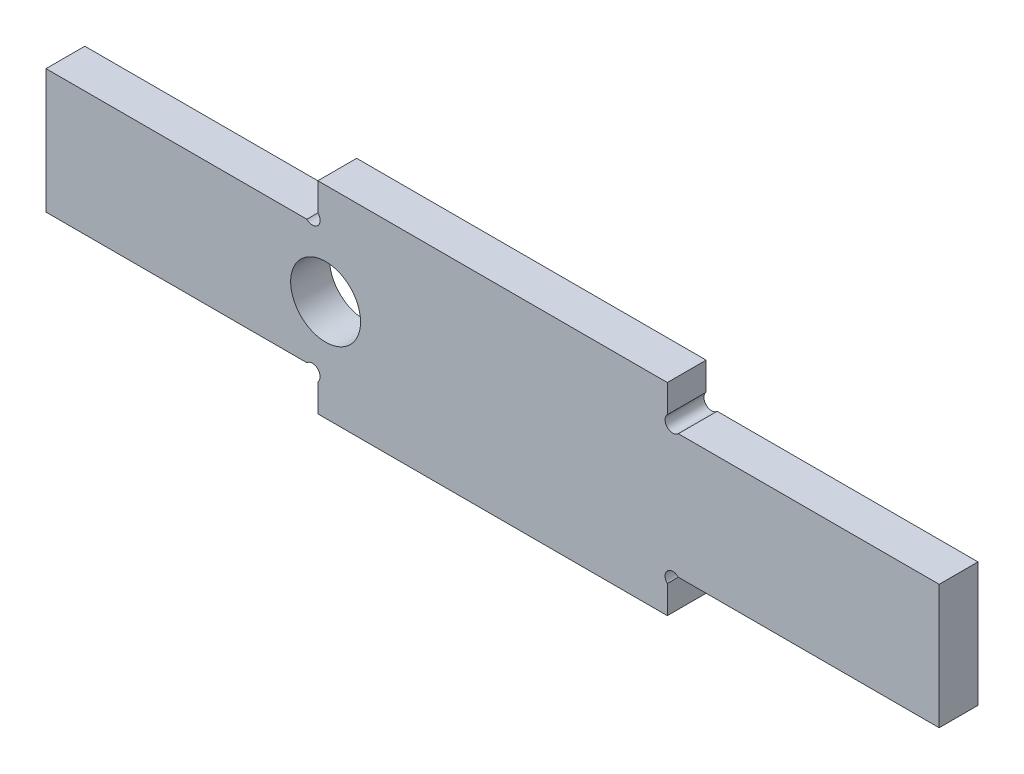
ISO-10303-21;
HEADER;
FILE_DESCRIPTION(('STEP AP214'),'2;1');
FILE_NAME('part.step','',(''),(''),'','','');
FILE_SCHEMA(('AUTOMOTIVE_DESIGN { 1 0 10303 214 1 1 1 1 }'));
ENDSEC;
DATA;
#1=APPLICATION_CONTEXT('core data for automotive mechanical design processes');
#2=APPLICATION_PROTOCOL_DEFINITION('international standard','automotive_design',2000,#1);
#3=PRODUCT_CONTEXT('',#1,'mechanical');
#4=PRODUCT('Part','Part','',(#3));
#5=PRODUCT_RELATED_PRODUCT_CATEGORY('part','',(#4));
#6=PRODUCT_DEFINITION_FORMATION('','',#4);
#7=PRODUCT_DEFINITION_CONTEXT('part definition',#1,'design');
#8=PRODUCT_DEFINITION('design','',#6,#7);
#9=PRODUCT_DEFINITION_SHAPE('','',#8);
#10=(LENGTH_UNIT() NAMED_UNIT(*) SI_UNIT(.MILLI.,.METRE.));
#11=(NAMED_UNIT(*) PLANE_ANGLE_UNIT() SI_UNIT($,.RADIAN.));
#12=(NAMED_UNIT(*) SI_UNIT($,.STERADIAN.) SOLID_ANGLE_UNIT());
#13=UNCERTAINTY_MEASURE_WITH_UNIT(LENGTH_MEASURE(1.E-05),#10,'distance_accuracy_value','');
#14=(GEOMETRIC_REPRESENTATION_CONTEXT(3) GLOBAL_UNCERTAINTY_ASSIGNED_CONTEXT((#13)) GLOBAL_UNIT_ASSIGNED_CONTEXT((#10,
#11,#12)) REPRESENTATION_CONTEXT('',''));
#15=CARTESIAN_POINT('',(0.,0.,0.));
#16=DIRECTION('',(0.,0.,1.));
#17=DIRECTION('',(1.,0.,0.));
#18=AXIS2_PLACEMENT_3D('',#15,#16,#17);
#19=CARTESIAN_POINT('',(0.,26.,5.));
#20=DIRECTION('',(0.,0.,-1.));
#21=DIRECTION('',(-1.,0.,0.));
#22=AXIS2_PLACEMENT_3D('',#19,#20,#21);
#23=PLANE('',#22);
#24=CARTESIAN_POINT('',(36.,13.,5.));
#25=DIRECTION('',(0.,0.,1.));
#26=DIRECTION('',(1.,0.,0.));
#27=AXIS2_PLACEMENT_3D('',#24,#25,#26);
#28=CIRCLE('',#27,4.5);
#29=CARTESIAN_POINT('',(40.5,13.,5.));
#30=VERTEX_POINT('',#29);
#31=EDGE_CURVE('E166',#30,#30,#28,.T.);
#32=ORIENTED_EDGE('',*,*,#31,.F.);
#33=EDGE_LOOP('',(#32));
#34=FACE_BOUND('',#33,.T.);
#35=DIRECTION('',(0.,1.,0.));
#36=VECTOR('',#35,1.);
#37=CARTESIAN_POINT('',(80.,0.,5.));
#38=LINE('',#37,#36);
#39=CARTESIAN_POINT('',(80.,0.,5.));
#40=VERTEX_POINT('',#39);
#41=CARTESIAN_POINT('',(80.,3.5857864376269,5.));
#42=VERTEX_POINT('',#41);
#43=EDGE_CURVE('E49',#40,#42,#38,.T.);
#44=ORIENTED_EDGE('',*,*,#43,.T.);
#45=CARTESIAN_POINT('',(80.7071067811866,4.29289321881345,5.));
#46=DIRECTION('',(0.,0.,-1.));
#47=DIRECTION('',(-1.,0.,0.));
#48=AXIS2_PLACEMENT_3D('',#45,#46,#47);
#49=CIRCLE('',#48,0.999999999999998);
#50=CARTESIAN_POINT('',(81.4142135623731,5.,5.));
#51=VERTEX_POINT('',#50);
#52=EDGE_CURVE('E160',#42,#51,#49,.T.);
#53=ORIENTED_EDGE('',*,*,#52,.T.);
#54=DIRECTION('',(1.,0.,0.));
#55=VECTOR('',#54,1.);
#56=CARTESIAN_POINT('',(115.,5.,5.));
#57=LINE('',#56,#55);
#58=CARTESIAN_POINT('',(115.,5.,5.));
#59=VERTEX_POINT('',#58);
#60=EDGE_CURVE('E170',#51,#59,#57,.T.);
#61=ORIENTED_EDGE('',*,*,#60,.T.);
#62=DIRECTION('',(0.,-1.,0.));
#63=VECTOR('',#62,1.);
#64=CARTESIAN_POINT('',(115.,0.,5.));
#65=LINE('',#64,#63);
#66=CARTESIAN_POINT('',(115.,21.,5.));
#67=VERTEX_POINT('',#66);
#68=EDGE_CURVE('E198',#67,#59,#65,.T.);
#69=ORIENTED_EDGE('',*,*,#68,.F.);
#70=DIRECTION('',(-1.,0.,0.));
#71=VECTOR('',#70,1.);
#72=CARTESIAN_POINT('',(115.,21.,5.));
#73=LINE('',#72,#71);
#74=CARTESIAN_POINT('',(81.4142135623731,21.,5.));
#75=VERTEX_POINT('',#74);
#76=EDGE_CURVE('E57',#67,#75,#73,.T.);
#77=ORIENTED_EDGE('',*,*,#76,.T.);
#78=CARTESIAN_POINT('',(80.7071067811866,21.7071067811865,5.));
#79=DIRECTION('',(0.,0.,-1.));
#80=DIRECTION('',(-1.,0.,0.));
#81=AXIS2_PLACEMENT_3D('',#78,#79,#80);
#82=CIRCLE('',#81,0.999999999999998);
#83=CARTESIAN_POINT('',(80.,22.4142135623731,5.));
#84=VERTEX_POINT('',#83);
#85=EDGE_CURVE('E174',#75,#84,#82,.T.);
#86=ORIENTED_EDGE('',*,*,#85,.T.);
#87=DIRECTION('',(0.,1.,0.));
#88=VECTOR('',#87,1.);
#89=CARTESIAN_POINT('',(80.,26.,5.));
#90=LINE('',#89,#88);
#91=CARTESIAN_POINT('',(80.,26.,5.));
#92=VERTEX_POINT('',#91);
#93=EDGE_CURVE('E189',#84,#92,#90,.T.);
#94=ORIENTED_EDGE('',*,*,#93,.T.);
#95=DIRECTION('',(-1.,0.,0.));
#96=VECTOR('',#95,1.);
#97=CARTESIAN_POINT('',(0.,26.,5.));
#98=LINE('',#97,#96);
#99=CARTESIAN_POINT('',(35.,26.,5.));
#100=VERTEX_POINT('',#99);
#101=EDGE_CURVE('E11',#92,#100,#98,.T.);
#102=ORIENTED_EDGE('',*,*,#101,.T.);
#103=DIRECTION('',(0.,1.,0.));
#104=VECTOR('',#103,1.);
#105=CARTESIAN_POINT('',(35.,26.,5.));
#106=LINE('',#105,#104);
#107=CARTESIAN_POINT('',(35.,22.4142135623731,5.));
#108=VERTEX_POINT('',#107);
#109=EDGE_CURVE('E241',#108,#100,#106,.T.);
#110=ORIENTED_EDGE('',*,*,#109,.F.);
#111=CARTESIAN_POINT('',(34.2928932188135,21.7071067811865,5.));
#112=DIRECTION('',(0.,0.,1.));
#113=DIRECTION('',(1.,0.,0.));
#114=AXIS2_PLACEMENT_3D('',#111,#112,#113);
#115=CIRCLE('',#114,0.999999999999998);
#116=CARTESIAN_POINT('',(33.5857864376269,21.,5.));
#117=VERTEX_POINT('',#116);
#118=EDGE_CURVE('E216',#117,#108,#115,.T.);
#119=ORIENTED_EDGE('',*,*,#118,.F.);
#120=DIRECTION('',(1.,0.,0.));
#121=VECTOR('',#120,1.);
#122=CARTESIAN_POINT('',(0.,21.,5.));
#123=LINE('',#122,#121);
#124=CARTESIAN_POINT('',(0.,21.,5.));
#125=VERTEX_POINT('',#124);
#126=EDGE_CURVE('E238',#125,#117,#123,.T.);
#127=ORIENTED_EDGE('',*,*,#126,.F.);
#128=DIRECTION('',(0.,-1.,0.));
#129=VECTOR('',#128,1.);
#130=CARTESIAN_POINT('',(0.,0.,5.));
#131=LINE('',#130,#129);
#132=CARTESIAN_POINT('',(0.,5.,5.));
#133=VERTEX_POINT('',#132);
#134=EDGE_CURVE('E253',#125,#133,#131,.T.);
#135=ORIENTED_EDGE('',*,*,#134,.T.);
#136=DIRECTION('',(-1.,0.,0.));
#137=VECTOR('',#136,1.);
#138=CARTESIAN_POINT('',(0.,5.,5.));
#139=LINE('',#138,#137);
#140=CARTESIAN_POINT('',(33.5857864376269,5.,5.));
#141=VERTEX_POINT('',#140);
#142=EDGE_CURVE('E228',#141,#133,#139,.T.);
#143=ORIENTED_EDGE('',*,*,#142,.F.);
#144=CARTESIAN_POINT('',(34.2928932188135,4.29289321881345,5.));
#145=DIRECTION('',(0.,0.,1.));
#146=DIRECTION('',(1.,0.,0.));
#147=AXIS2_PLACEMENT_3D('',#144,#145,#146);
#148=CIRCLE('',#147,0.999999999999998);
#149=CARTESIAN_POINT('',(35.,3.5857864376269,5.));
#150=VERTEX_POINT('',#149);
#151=EDGE_CURVE('E210',#150,#141,#148,.T.);
#152=ORIENTED_EDGE('',*,*,#151,.F.);
#153=DIRECTION('',(0.,1.,0.));
#154=VECTOR('',#153,1.);
#155=CARTESIAN_POINT('',(35.,0.,5.));
#156=LINE('',#155,#154);
#157=CARTESIAN_POINT('',(35.,0.,5.));
#158=VERTEX_POINT('',#157);
#159=EDGE_CURVE('E225',#158,#150,#156,.T.);
#160=ORIENTED_EDGE('',*,*,#159,.F.);
#161=DIRECTION('',(1.,0.,0.));
#162=VECTOR('',#161,1.);
#163=CARTESIAN_POINT('',(0.,0.,5.));
#164=LINE('',#163,#162);
#165=EDGE_CURVE('E41',#158,#40,#164,.T.);
#166=ORIENTED_EDGE('',*,*,#165,.T.);
#167=EDGE_LOOP('',(#44,#53,#61,#69,#77,#86,#94,#102,#110,#119,#127,#135,#143,#152,#160,#166));
#168=FACE_BOUND('',#167,.T.);
#169=ADVANCED_FACE('F32',(#34,#168),#23,.F.);
#170=CARTESIAN_POINT('',(0.,26.,0.));
#171=DIRECTION('',(0.,0.,-1.));
#172=DIRECTION('',(-1.,0.,0.));
#173=AXIS2_PLACEMENT_3D('',#170,#171,#172);
#174=PLANE('',#173);
#175=CARTESIAN_POINT('',(36.,13.,0.));
#176=DIRECTION('',(0.,0.,-1.));
#177=DIRECTION('',(-1.,0.,0.));
#178=AXIS2_PLACEMENT_3D('',#175,#176,#177);
#179=CIRCLE('',#178,4.5);
#180=CARTESIAN_POINT('',(31.5,13.,0.));
#181=VERTEX_POINT('',#180);
#182=EDGE_CURVE('E301',#181,#181,#179,.F.);
#183=ORIENTED_EDGE('',*,*,#182,.T.);
#184=EDGE_LOOP('',(#183));
#185=FACE_BOUND('',#184,.T.);
#186=CARTESIAN_POINT('',(80.7071067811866,4.29289321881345,0.));
#187=DIRECTION('',(0.,0.,-1.));
#188=DIRECTION('',(-1.,0.,0.));
#189=AXIS2_PLACEMENT_3D('',#186,#187,#188);
#190=CIRCLE('',#189,0.999999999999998);
#191=CARTESIAN_POINT('',(80.,3.5857864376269,0.));
#192=VERTEX_POINT('',#191);
#193=CARTESIAN_POINT('',(81.4142135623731,5.,0.));
#194=VERTEX_POINT('',#193);
#195=EDGE_CURVE('E148',#192,#194,#190,.T.);
#196=ORIENTED_EDGE('',*,*,#195,.F.);
#197=DIRECTION('',(0.,1.,0.));
#198=VECTOR('',#197,1.);
#199=CARTESIAN_POINT('',(80.,0.,0.));
#200=LINE('',#199,#198);
#201=CARTESIAN_POINT('',(80.,0.,0.));
#202=VERTEX_POINT('',#201);
#203=EDGE_CURVE('E153',#202,#192,#200,.T.);
#204=ORIENTED_EDGE('',*,*,#203,.F.);
#205=DIRECTION('',(1.,0.,0.));
#206=VECTOR('',#205,1.);
#207=CARTESIAN_POINT('',(0.,0.,0.));
#208=LINE('',#207,#206);
#209=CARTESIAN_POINT('',(35.,0.,0.));
#210=VERTEX_POINT('',#209);
#211=EDGE_CURVE('E259',#210,#202,#208,.T.);
#212=ORIENTED_EDGE('',*,*,#211,.F.);
#213=DIRECTION('',(0.,1.,0.));
#214=VECTOR('',#213,1.);
#215=CARTESIAN_POINT('',(35.,0.,0.));
#216=LINE('',#215,#214);
#217=CARTESIAN_POINT('',(35.,3.5857864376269,0.));
#218=VERTEX_POINT('',#217);
#219=EDGE_CURVE('E220',#210,#218,#216,.T.);
#220=ORIENTED_EDGE('',*,*,#219,.T.);
#221=CARTESIAN_POINT('',(34.2928932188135,4.29289321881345,0.));
#222=DIRECTION('',(0.,0.,-1.));
#223=DIRECTION('',(-1.,0.,0.));
#224=AXIS2_PLACEMENT_3D('',#221,#222,#223);
#225=CIRCLE('',#224,0.999999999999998);
#226=CARTESIAN_POINT('',(33.5857864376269,5.,0.));
#227=VERTEX_POINT('',#226);
#228=EDGE_CURVE('E212',#218,#227,#225,.F.);
#229=ORIENTED_EDGE('',*,*,#228,.T.);
#230=DIRECTION('',(-1.,0.,0.));
#231=VECTOR('',#230,1.);
#232=CARTESIAN_POINT('',(0.,5.,0.));
#233=LINE('',#232,#231);
#234=CARTESIAN_POINT('',(0.,5.,0.));
#235=VERTEX_POINT('',#234);
#236=EDGE_CURVE('E223',#227,#235,#233,.T.);
#237=ORIENTED_EDGE('',*,*,#236,.T.);
#238=DIRECTION('',(0.,-1.,0.));
#239=VECTOR('',#238,1.);
#240=CARTESIAN_POINT('',(0.,0.,0.));
#241=LINE('',#240,#239);
#242=CARTESIAN_POINT('',(0.,21.,0.));
#243=VERTEX_POINT('',#242);
#244=EDGE_CURVE('E252',#243,#235,#241,.T.);
#245=ORIENTED_EDGE('',*,*,#244,.F.);
#246=DIRECTION('',(1.,0.,0.));
#247=VECTOR('',#246,1.);
#248=CARTESIAN_POINT('',(0.,21.,0.));
#249=LINE('',#248,#247);
#250=CARTESIAN_POINT('',(33.5857864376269,21.,0.));
#251=VERTEX_POINT('',#250);
#252=EDGE_CURVE('E248',#243,#251,#249,.T.);
#253=ORIENTED_EDGE('',*,*,#252,.T.);
#254=CARTESIAN_POINT('',(34.2928932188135,21.7071067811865,0.));
#255=DIRECTION('',(0.,0.,-1.));
#256=DIRECTION('',(-1.,0.,0.));
#257=AXIS2_PLACEMENT_3D('',#254,#255,#256);
#258=CIRCLE('',#257,0.999999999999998);
#259=CARTESIAN_POINT('',(35.,22.4142135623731,0.));
#260=VERTEX_POINT('',#259);
#261=EDGE_CURVE('E218',#251,#260,#258,.F.);
#262=ORIENTED_EDGE('',*,*,#261,.T.);
#263=DIRECTION('',(0.,1.,0.));
#264=VECTOR('',#263,1.);
#265=CARTESIAN_POINT('',(35.,26.,0.));
#266=LINE('',#265,#264);
#267=CARTESIAN_POINT('',(35.,26.,0.));
#268=VERTEX_POINT('',#267);
#269=EDGE_CURVE('E234',#260,#268,#266,.T.);
#270=ORIENTED_EDGE('',*,*,#269,.T.);
#271=DIRECTION('',(-1.,0.,0.));
#272=VECTOR('',#271,1.);
#273=CARTESIAN_POINT('',(0.,26.,0.));
#274=LINE('',#273,#272);
#275=CARTESIAN_POINT('',(80.,26.,0.));
#276=VERTEX_POINT('',#275);
#277=EDGE_CURVE('E36',#276,#268,#274,.T.);
#278=ORIENTED_EDGE('',*,*,#277,.F.);
#279=DIRECTION('',(0.,1.,0.));
#280=VECTOR('',#279,1.);
#281=CARTESIAN_POINT('',(80.,26.,0.));
#282=LINE('',#281,#280);
#283=CARTESIAN_POINT('',(80.,22.4142135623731,0.));
#284=VERTEX_POINT('',#283);
#285=EDGE_CURVE('E184',#284,#276,#282,.T.);
#286=ORIENTED_EDGE('',*,*,#285,.F.);
#287=CARTESIAN_POINT('',(80.7071067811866,21.7071067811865,0.));
#288=DIRECTION('',(0.,0.,-1.));
#289=DIRECTION('',(-1.,0.,0.));
#290=AXIS2_PLACEMENT_3D('',#287,#288,#289);
#291=CIRCLE('',#290,0.999999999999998);
#292=CARTESIAN_POINT('',(81.4142135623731,21.,0.));
#293=VERTEX_POINT('',#292);
#294=EDGE_CURVE('E171',#293,#284,#291,.T.);
#295=ORIENTED_EDGE('',*,*,#294,.F.);
#296=DIRECTION('',(-1.,0.,0.));
#297=VECTOR('',#296,1.);
#298=CARTESIAN_POINT('',(115.,21.,0.));
#299=LINE('',#298,#297);
#300=CARTESIAN_POINT('',(115.,21.,0.));
#301=VERTEX_POINT('',#300);
#302=EDGE_CURVE('E186',#301,#293,#299,.T.);
#303=ORIENTED_EDGE('',*,*,#302,.F.);
#304=DIRECTION('',(0.,-1.,0.));
#305=VECTOR('',#304,1.);
#306=CARTESIAN_POINT('',(115.,0.,0.));
#307=LINE('',#306,#305);
#308=CARTESIAN_POINT('',(115.,5.,0.));
#309=VERTEX_POINT('',#308);
#310=EDGE_CURVE('E195',#301,#309,#307,.T.);
#311=ORIENTED_EDGE('',*,*,#310,.T.);
#312=DIRECTION('',(1.,0.,0.));
#313=VECTOR('',#312,1.);
#314=CARTESIAN_POINT('',(115.,5.,0.));
#315=LINE('',#314,#313);
#316=EDGE_CURVE('E156',#194,#309,#315,.T.);
#317=ORIENTED_EDGE('',*,*,#316,.F.);
#318=EDGE_LOOP('',(#196,#204,#212,#220,#229,#237,#245,#253,#262,#270,#278,#286,#295,#303,#311,#317));
#319=FACE_BOUND('',#318,.T.);
#320=ADVANCED_FACE('F150',(#185,#319),#174,.T.);
#321=CARTESIAN_POINT('',(80.,0.,-0.00100000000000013));
#322=DIRECTION('',(1.,0.,0.));
#323=DIRECTION('',(0.,0.,-1.));
#324=AXIS2_PLACEMENT_3D('',#321,#322,#323);
#325=PLANE('',#324);
#326=ORIENTED_EDGE('',*,*,#203,.T.);
#327=DIRECTION('',(0.,0.,1.));
#328=VECTOR('',#327,1.);
#329=CARTESIAN_POINT('',(80.,3.5857864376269,-0.00100000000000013));
#330=LINE('',#329,#328);
#331=EDGE_CURVE('E162',#42,#192,#330,.F.);
#332=ORIENTED_EDGE('',*,*,#331,.F.);
#333=ORIENTED_EDGE('',*,*,#43,.F.);
#334=DIRECTION('',(0.,0.,1.));
#335=VECTOR('',#334,1.);
#336=CARTESIAN_POINT('',(80.,0.,-0.00100000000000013));
#337=LINE('',#336,#335);
#338=EDGE_CURVE('E169',#202,#40,#337,.T.);
#339=ORIENTED_EDGE('',*,*,#338,.F.);
#340=EDGE_LOOP('',(#326,#332,#333,#339));
#341=FACE_BOUND('',#340,.T.);
#342=ADVANCED_FACE('F168',(#341),#325,.T.);
#343=CARTESIAN_POINT('',(115.,21.,-0.00100000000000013));
#344=DIRECTION('',(0.,1.,0.));
#345=DIRECTION('',(0.,0.,1.));
#346=AXIS2_PLACEMENT_3D('',#343,#344,#345);
#347=PLANE('',#346);
#348=ORIENTED_EDGE('',*,*,#302,.T.);
#349=DIRECTION('',(0.,0.,1.));
#350=VECTOR('',#349,1.);
#351=CARTESIAN_POINT('',(81.4142135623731,21.,-0.00100000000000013));
#352=LINE('',#351,#350);
#353=EDGE_CURVE('E165',#75,#293,#352,.F.);
#354=ORIENTED_EDGE('',*,*,#353,.F.);
#355=ORIENTED_EDGE('',*,*,#76,.F.);
#356=DIRECTION('',(0.,0.,1.));
#357=VECTOR('',#356,1.);
#358=CARTESIAN_POINT('',(115.,21.,-0.00100000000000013));
#359=LINE('',#358,#357);
#360=EDGE_CURVE('E193',#301,#67,#359,.T.);
#361=ORIENTED_EDGE('',*,*,#360,.F.);
#362=EDGE_LOOP('',(#348,#354,#355,#361));
#363=FACE_BOUND('',#362,.T.);
#364=ADVANCED_FACE('F289',(#363),#347,.T.);
#365=CARTESIAN_POINT('',(115.,5.,-0.00100000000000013));
#366=DIRECTION('',(0.,-1.,0.));
#367=DIRECTION('',(0.,0.,-1.));
#368=AXIS2_PLACEMENT_3D('',#365,#366,#367);
#369=PLANE('',#368);
#370=ORIENTED_EDGE('',*,*,#60,.F.);
#371=DIRECTION('',(0.,0.,1.));
#372=VECTOR('',#371,1.);
#373=CARTESIAN_POINT('',(81.4142135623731,5.,-0.00100000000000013));
#374=LINE('',#373,#372);
#375=EDGE_CURVE('E287',#194,#51,#374,.T.);
#376=ORIENTED_EDGE('',*,*,#375,.F.);
#377=ORIENTED_EDGE('',*,*,#316,.T.);
#378=DIRECTION('',(0.,0.,1.));
#379=VECTOR('',#378,1.);
#380=CARTESIAN_POINT('',(115.,5.,-0.00100000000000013));
#381=LINE('',#380,#379);
#382=EDGE_CURVE('E179',#309,#59,#381,.T.);
#383=ORIENTED_EDGE('',*,*,#382,.T.);
#384=EDGE_LOOP('',(#370,#376,#377,#383));
#385=FACE_BOUND('',#384,.T.);
#386=ADVANCED_FACE('F296',(#385),#369,.T.);
#387=CARTESIAN_POINT('',(80.,26.,-0.00100000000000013));
#388=DIRECTION('',(1.,0.,0.));
#389=DIRECTION('',(0.,0.,-1.));
#390=AXIS2_PLACEMENT_3D('',#387,#388,#389);
#391=PLANE('',#390);
#392=ORIENTED_EDGE('',*,*,#93,.F.);
#393=DIRECTION('',(0.,0.,1.));
#394=VECTOR('',#393,1.);
#395=CARTESIAN_POINT('',(80.,22.4142135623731,-0.00100000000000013));
#396=LINE('',#395,#394);
#397=EDGE_CURVE('E159',#284,#84,#396,.T.);
#398=ORIENTED_EDGE('',*,*,#397,.F.);
#399=ORIENTED_EDGE('',*,*,#285,.T.);
#400=DIRECTION('',(0.,0.,1.));
#401=VECTOR('',#400,1.);
#402=CARTESIAN_POINT('',(80.,26.,-0.00100000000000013));
#403=LINE('',#402,#401);
#404=EDGE_CURVE('E192',#276,#92,#403,.T.);
#405=ORIENTED_EDGE('',*,*,#404,.T.);
#406=EDGE_LOOP('',(#392,#398,#399,#405));
#407=FACE_BOUND('',#406,.T.);
#408=ADVANCED_FACE('F281',(#407),#391,.T.);
#409=CARTESIAN_POINT('',(115.,0.,5.));
#410=DIRECTION('',(1.,0.,0.));
#411=DIRECTION('',(0.,0.,-1.));
#412=AXIS2_PLACEMENT_3D('',#409,#410,#411);
#413=PLANE('',#412);
#414=ORIENTED_EDGE('',*,*,#68,.T.);
#415=ORIENTED_EDGE('',*,*,#382,.F.);
#416=ORIENTED_EDGE('',*,*,#310,.F.);
#417=ORIENTED_EDGE('',*,*,#360,.T.);
#418=EDGE_LOOP('',(#414,#415,#416,#417));
#419=FACE_BOUND('',#418,.T.);
#420=ADVANCED_FACE('F292',(#419),#413,.T.);
#421=CARTESIAN_POINT('',(0.,0.,5.));
#422=DIRECTION('',(0.,1.,0.));
#423=DIRECTION('',(0.,0.,1.));
#424=AXIS2_PLACEMENT_3D('',#421,#422,#423);
#425=PLANE('',#424);
#426=ORIENTED_EDGE('',*,*,#338,.T.);
#427=ORIENTED_EDGE('',*,*,#165,.F.);
#428=DIRECTION('',(0.,0.,1.));
#429=VECTOR('',#428,1.);
#430=CARTESIAN_POINT('',(35.,0.,-0.00100000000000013));
#431=LINE('',#430,#429);
#432=EDGE_CURVE('E230',#210,#158,#431,.T.);
#433=ORIENTED_EDGE('',*,*,#432,.F.);
#434=ORIENTED_EDGE('',*,*,#211,.T.);
#435=EDGE_LOOP('',(#426,#427,#433,#434));
#436=FACE_BOUND('',#435,.T.);
#437=ADVANCED_FACE('F321',(#436),#425,.F.);
#438=CARTESIAN_POINT('',(0.,26.,5.));
#439=DIRECTION('',(0.,-1.,0.));
#440=DIRECTION('',(0.,0.,-1.));
#441=AXIS2_PLACEMENT_3D('',#438,#439,#440);
#442=PLANE('',#441);
#443=ORIENTED_EDGE('',*,*,#404,.F.);
#444=ORIENTED_EDGE('',*,*,#277,.T.);
#445=DIRECTION('',(0.,0.,1.));
#446=VECTOR('',#445,1.);
#447=CARTESIAN_POINT('',(35.,26.,-0.00100000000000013));
#448=LINE('',#447,#446);
#449=EDGE_CURVE('E245',#268,#100,#448,.T.);
#450=ORIENTED_EDGE('',*,*,#449,.T.);
#451=ORIENTED_EDGE('',*,*,#101,.F.);
#452=EDGE_LOOP('',(#443,#444,#450,#451));
#453=FACE_BOUND('',#452,.T.);
#454=ADVANCED_FACE('F265',(#453),#442,.F.);
#455=CARTESIAN_POINT('',(0.,0.,5.));
#456=DIRECTION('',(1.,0.,0.));
#457=DIRECTION('',(0.,0.,-1.));
#458=AXIS2_PLACEMENT_3D('',#455,#456,#457);
#459=PLANE('',#458);
#460=ORIENTED_EDGE('',*,*,#244,.T.);
#461=DIRECTION('',(0.,0.,1.));
#462=VECTOR('',#461,1.);
#463=CARTESIAN_POINT('',(0.,5.,-0.00100000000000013));
#464=LINE('',#463,#462);
#465=EDGE_CURVE('E231',#235,#133,#464,.T.);
#466=ORIENTED_EDGE('',*,*,#465,.T.);
#467=ORIENTED_EDGE('',*,*,#134,.F.);
#468=DIRECTION('',(0.,0.,1.));
#469=VECTOR('',#468,1.);
#470=CARTESIAN_POINT('',(0.,21.,-0.00100000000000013));
#471=LINE('',#470,#469);
#472=EDGE_CURVE('E244',#243,#125,#471,.T.);
#473=ORIENTED_EDGE('',*,*,#472,.F.);
#474=EDGE_LOOP('',(#460,#466,#467,#473));
#475=FACE_BOUND('',#474,.T.);
#476=ADVANCED_FACE('F34',(#475),#459,.F.);
#477=CARTESIAN_POINT('',(35.,26.,-0.00100000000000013));
#478=DIRECTION('',(1.,0.,0.));
#479=DIRECTION('',(0.,0.,-1.));
#480=AXIS2_PLACEMENT_3D('',#477,#478,#479);
#481=PLANE('',#480);
#482=ORIENTED_EDGE('',*,*,#269,.F.);
#483=DIRECTION('',(0.,0.,1.));
#484=VECTOR('',#483,1.);
#485=CARTESIAN_POINT('',(35.,22.4142135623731,-0.00100000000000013));
#486=LINE('',#485,#484);
#487=EDGE_CURVE('E205',#108,#260,#486,.F.);
#488=ORIENTED_EDGE('',*,*,#487,.F.);
#489=ORIENTED_EDGE('',*,*,#109,.T.);
#490=ORIENTED_EDGE('',*,*,#449,.F.);
#491=EDGE_LOOP('',(#482,#488,#489,#490));
#492=FACE_BOUND('',#491,.T.);
#493=ADVANCED_FACE('F272',(#492),#481,.F.);
#494=CARTESIAN_POINT('',(0.,21.,-0.00100000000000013));
#495=DIRECTION('',(0.,-1.,0.));
#496=DIRECTION('',(0.,0.,-1.));
#497=AXIS2_PLACEMENT_3D('',#494,#495,#496);
#498=PLANE('',#497);
#499=ORIENTED_EDGE('',*,*,#126,.T.);
#500=DIRECTION('',(0.,0.,1.));
#501=VECTOR('',#500,1.);
#502=CARTESIAN_POINT('',(33.5857864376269,21.,-0.00100000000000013));
#503=LINE('',#502,#501);
#504=EDGE_CURVE('E214',#251,#117,#503,.T.);
#505=ORIENTED_EDGE('',*,*,#504,.F.);
#506=ORIENTED_EDGE('',*,*,#252,.F.);
#507=ORIENTED_EDGE('',*,*,#472,.T.);
#508=EDGE_LOOP('',(#499,#505,#506,#507));
#509=FACE_BOUND('',#508,.T.);
#510=ADVANCED_FACE('F317',(#509),#498,.F.);
#511=CARTESIAN_POINT('',(0.,5.,-0.00100000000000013));
#512=DIRECTION('',(0.,1.,0.));
#513=DIRECTION('',(0.,0.,1.));
#514=AXIS2_PLACEMENT_3D('',#511,#512,#513);
#515=PLANE('',#514);
#516=ORIENTED_EDGE('',*,*,#236,.F.);
#517=DIRECTION('',(0.,0.,1.));
#518=VECTOR('',#517,1.);
#519=CARTESIAN_POINT('',(33.5857864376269,5.,-0.00100000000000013));
#520=LINE('',#519,#518);
#521=EDGE_CURVE('E201',#141,#227,#520,.F.);
#522=ORIENTED_EDGE('',*,*,#521,.F.);
#523=ORIENTED_EDGE('',*,*,#142,.T.);
#524=ORIENTED_EDGE('',*,*,#465,.F.);
#525=EDGE_LOOP('',(#516,#522,#523,#524));
#526=FACE_BOUND('',#525,.T.);
#527=ADVANCED_FACE('F341',(#526),#515,.F.);
#528=CARTESIAN_POINT('',(35.,0.,-0.00100000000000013));
#529=DIRECTION('',(1.,0.,0.));
#530=DIRECTION('',(0.,0.,-1.));
#531=AXIS2_PLACEMENT_3D('',#528,#529,#530);
#532=PLANE('',#531);
#533=ORIENTED_EDGE('',*,*,#159,.T.);
#534=DIRECTION('',(0.,0.,1.));
#535=VECTOR('',#534,1.);
#536=CARTESIAN_POINT('',(35.,3.5857864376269,-0.00100000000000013));
#537=LINE('',#536,#535);
#538=EDGE_CURVE('E208',#218,#150,#537,.T.);
#539=ORIENTED_EDGE('',*,*,#538,.F.);
#540=ORIENTED_EDGE('',*,*,#219,.F.);
#541=ORIENTED_EDGE('',*,*,#432,.T.);
#542=EDGE_LOOP('',(#533,#539,#540,#541));
#543=FACE_BOUND('',#542,.T.);
#544=ADVANCED_FACE('F333',(#543),#532,.F.);
#545=CARTESIAN_POINT('',(34.2928932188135,21.7071067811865,-0.00100000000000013));
#546=DIRECTION('',(0.,0.,1.));
#547=DIRECTION('',(1.,0.,0.));
#548=AXIS2_PLACEMENT_3D('',#545,#546,#547);
#549=CYLINDRICAL_SURFACE('',#548,0.999999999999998);
#550=ORIENTED_EDGE('',*,*,#118,.T.);
#551=ORIENTED_EDGE('',*,*,#487,.T.);
#552=ORIENTED_EDGE('',*,*,#261,.F.);
#553=ORIENTED_EDGE('',*,*,#504,.T.);
#554=EDGE_LOOP('',(#550,#551,#552,#553));
#555=FACE_BOUND('',#554,.T.);
#556=ADVANCED_FACE('F348',(#555),#549,.F.);
#557=CARTESIAN_POINT('',(34.2928932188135,4.29289321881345,-0.00100000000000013));
#558=DIRECTION('',(0.,0.,1.));
#559=DIRECTION('',(1.,0.,0.));
#560=AXIS2_PLACEMENT_3D('',#557,#558,#559);
#561=CYLINDRICAL_SURFACE('',#560,0.999999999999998);
#562=ORIENTED_EDGE('',*,*,#151,.T.);
#563=ORIENTED_EDGE('',*,*,#521,.T.);
#564=ORIENTED_EDGE('',*,*,#228,.F.);
#565=ORIENTED_EDGE('',*,*,#538,.T.);
#566=EDGE_LOOP('',(#562,#563,#564,#565));
#567=FACE_BOUND('',#566,.T.);
#568=ADVANCED_FACE('F339',(#567),#561,.F.);
#569=CARTESIAN_POINT('',(80.7071067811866,21.7071067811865,-0.00100000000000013));
#570=DIRECTION('',(0.,0.,1.));
#571=DIRECTION('',(1.,0.,0.));
#572=AXIS2_PLACEMENT_3D('',#569,#570,#571);
#573=CYLINDRICAL_SURFACE('',#572,0.999999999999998);
#574=ORIENTED_EDGE('',*,*,#397,.T.);
#575=ORIENTED_EDGE('',*,*,#85,.F.);
#576=ORIENTED_EDGE('',*,*,#353,.T.);
#577=ORIENTED_EDGE('',*,*,#294,.T.);
#578=EDGE_LOOP('',(#574,#575,#576,#577));
#579=FACE_BOUND('',#578,.T.);
#580=ADVANCED_FACE('F286',(#579),#573,.F.);
#581=CARTESIAN_POINT('',(80.7071067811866,4.29289321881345,-0.00100000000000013));
#582=DIRECTION('',(0.,0.,1.));
#583=DIRECTION('',(1.,0.,0.));
#584=AXIS2_PLACEMENT_3D('',#581,#582,#583);
#585=CYLINDRICAL_SURFACE('',#584,0.999999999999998);
#586=ORIENTED_EDGE('',*,*,#195,.T.);
#587=ORIENTED_EDGE('',*,*,#375,.T.);
#588=ORIENTED_EDGE('',*,*,#52,.F.);
#589=ORIENTED_EDGE('',*,*,#331,.T.);
#590=EDGE_LOOP('',(#586,#587,#588,#589));
#591=FACE_BOUND('',#590,.T.);
#592=ADVANCED_FACE('F163',(#591),#585,.F.);
#593=CARTESIAN_POINT('',(36.,13.,-0.00100000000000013));
#594=DIRECTION('',(0.,0.,1.));
#595=DIRECTION('',(1.,0.,0.));
#596=AXIS2_PLACEMENT_3D('',#593,#594,#595);
#597=CYLINDRICAL_SURFACE('',#596,4.5);
#598=ORIENTED_EDGE('',*,*,#182,.F.);
#599=EDGE_LOOP('',(#598));
#600=FACE_BOUND('',#599,.T.);
#601=ORIENTED_EDGE('',*,*,#31,.T.);
#602=EDGE_LOOP('',(#601));
#603=FACE_BOUND('',#602,.T.);
#604=ADVANCED_FACE('F307',(#600,#603),#597,.F.);
#605=CLOSED_SHELL('',(#169,#320,#342,#364,#386,#408,#420,#437,#454,#476,#493,#510,#527,#544,
#556,#568,#580,#592,#604));
#606=MANIFOLD_SOLID_BREP('B2',#605);
#607=ADVANCED_BREP_SHAPE_REPRESENTATION('',(#18,#606),#14);
#608=SHAPE_DEFINITION_REPRESENTATION(#9,#607);
ENDSEC;
END-ISO-10303-21;
